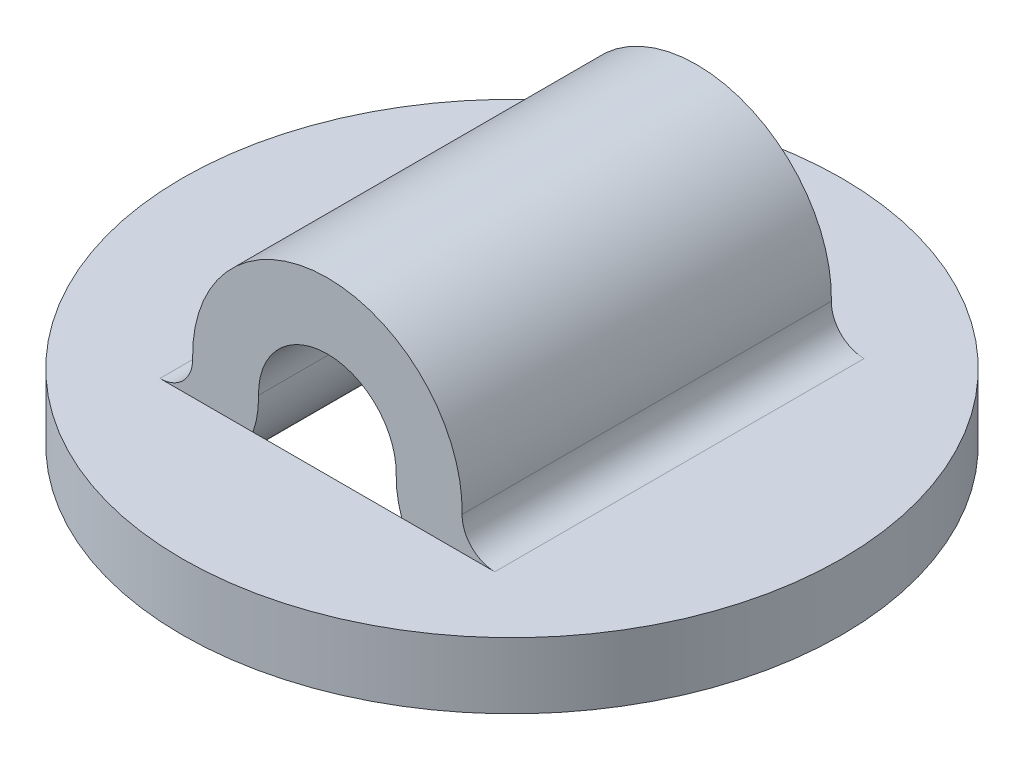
ISO-10303-21;
HEADER;
FILE_DESCRIPTION(('STEP AP214'),'2;1');
FILE_NAME('part.step','',(''),(''),'','','');
FILE_SCHEMA(('AUTOMOTIVE_DESIGN { 1 0 10303 214 1 1 1 1 }'));
ENDSEC;
DATA;
#1=APPLICATION_CONTEXT('core data for automotive mechanical design processes');
#2=APPLICATION_PROTOCOL_DEFINITION('international standard','automotive_design',2000,#1);
#3=PRODUCT_CONTEXT('',#1,'mechanical');
#4=PRODUCT('Part','Part','',(#3));
#5=PRODUCT_RELATED_PRODUCT_CATEGORY('part','',(#4));
#6=PRODUCT_DEFINITION_FORMATION('','',#4);
#7=PRODUCT_DEFINITION_CONTEXT('part definition',#1,'design');
#8=PRODUCT_DEFINITION('design','',#6,#7);
#9=PRODUCT_DEFINITION_SHAPE('','',#8);
#10=(LENGTH_UNIT() NAMED_UNIT(*) SI_UNIT(.MILLI.,.METRE.));
#11=(NAMED_UNIT(*) PLANE_ANGLE_UNIT() SI_UNIT($,.RADIAN.));
#12=(NAMED_UNIT(*) SI_UNIT($,.STERADIAN.) SOLID_ANGLE_UNIT());
#13=UNCERTAINTY_MEASURE_WITH_UNIT(LENGTH_MEASURE(1.E-05),#10,'distance_accuracy_value','');
#14=(GEOMETRIC_REPRESENTATION_CONTEXT(3) GLOBAL_UNCERTAINTY_ASSIGNED_CONTEXT((#13)) GLOBAL_UNIT_ASSIGNED_CONTEXT((#10,
#11,#12)) REPRESENTATION_CONTEXT('',''));
#15=CARTESIAN_POINT('',(0.,0.,0.));
#16=DIRECTION('',(0.,0.,1.));
#17=DIRECTION('',(1.,0.,0.));
#18=AXIS2_PLACEMENT_3D('',#15,#16,#17);
#19=CARTESIAN_POINT('',(0.,1.7399,17.78));
#20=DIRECTION('',(0.,0.,-1.));
#21=DIRECTION('',(-1.,0.,0.));
#22=AXIS2_PLACEMENT_3D('',#19,#20,#21);
#23=CYLINDRICAL_SURFACE('',#22,6.4897);
#24=DIRECTION('',(0.,0.,-1.));
#25=VECTOR('',#24,1.);
#26=CARTESIAN_POINT('',(6.48833987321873,1.60704,17.78));
#27=LINE('',#26,#25);
#28=CARTESIAN_POINT('',(6.48833987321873,1.60704,17.78));
#29=VERTEX_POINT('',#28);
#30=CARTESIAN_POINT('',(6.48833987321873,1.60704,0.));
#31=VERTEX_POINT('',#30);
#32=EDGE_CURVE('E98',#29,#31,#27,.T.);
#33=ORIENTED_EDGE('',*,*,#32,.T.);
#34=CARTESIAN_POINT('',(0.,1.7399,0.));
#35=DIRECTION('',(0.,0.,-1.));
#36=DIRECTION('',(-1.,0.,0.));
#37=AXIS2_PLACEMENT_3D('',#34,#35,#36);
#38=CIRCLE('',#37,6.4897);
#39=CARTESIAN_POINT('',(-6.48833987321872,1.60704,0.));
#40=VERTEX_POINT('',#39);
#41=EDGE_CURVE('E110',#40,#31,#38,.T.);
#42=ORIENTED_EDGE('',*,*,#41,.F.);
#43=DIRECTION('',(0.,0.,-1.));
#44=VECTOR('',#43,1.);
#45=CARTESIAN_POINT('',(-6.48833987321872,1.60704,17.78));
#46=LINE('',#45,#44);
#47=CARTESIAN_POINT('',(-6.48833987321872,1.60704,17.78));
#48=VERTEX_POINT('',#47);
#49=EDGE_CURVE('E113',#40,#48,#46,.F.);
#50=ORIENTED_EDGE('',*,*,#49,.T.);
#51=CARTESIAN_POINT('',(0.,1.7399,17.78));
#52=DIRECTION('',(0.,0.,-1.));
#53=DIRECTION('',(-1.,0.,0.));
#54=AXIS2_PLACEMENT_3D('',#51,#52,#53);
#55=CIRCLE('',#54,6.4897);
#56=EDGE_CURVE('E112',#48,#29,#55,.T.);
#57=ORIENTED_EDGE('',*,*,#56,.T.);
#58=EDGE_LOOP('',(#33,#42,#50,#57));
#59=FACE_BOUND('',#58,.T.);
#60=ADVANCED_FACE('F18',(#59),#23,.T.);
#61=CARTESIAN_POINT('',(-8.06280982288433,1.5748,17.78));
#62=DIRECTION('',(0.,0.,-1.));
#63=DIRECTION('',(-1.,0.,0.));
#64=AXIS2_PLACEMENT_3D('',#61,#62,#63);
#65=CYLINDRICAL_SURFACE('',#64,1.5748);
#66=CARTESIAN_POINT('',(-8.06280982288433,1.5748,17.78));
#67=DIRECTION('',(0.,0.,-1.));
#68=DIRECTION('',(-1.,0.,0.));
#69=AXIS2_PLACEMENT_3D('',#66,#67,#68);
#70=CIRCLE('',#69,1.5748);
#71=CARTESIAN_POINT('',(-8.06280982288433,0.,17.78));
#72=VERTEX_POINT('',#71);
#73=EDGE_CURVE('E21',#72,#48,#70,.F.);
#74=ORIENTED_EDGE('',*,*,#73,.T.);
#75=ORIENTED_EDGE('',*,*,#49,.F.);
#76=CARTESIAN_POINT('',(-8.06280982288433,1.5748,0.));
#77=DIRECTION('',(0.,0.,-1.));
#78=DIRECTION('',(-1.,0.,0.));
#79=AXIS2_PLACEMENT_3D('',#76,#77,#78);
#80=CIRCLE('',#79,1.5748);
#81=CARTESIAN_POINT('',(-8.06280982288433,0.,0.));
#82=VERTEX_POINT('',#81);
#83=EDGE_CURVE('E106',#82,#40,#80,.F.);
#84=ORIENTED_EDGE('',*,*,#83,.F.);
#85=DIRECTION('',(0.,0.,1.));
#86=VECTOR('',#85,1.);
#87=CARTESIAN_POINT('',(-8.06280982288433,0.,17.78));
#88=LINE('',#87,#86);
#89=EDGE_CURVE('E168',#82,#72,#88,.T.);
#90=ORIENTED_EDGE('',*,*,#89,.T.);
#91=EDGE_LOOP('',(#74,#75,#84,#90));
#92=FACE_BOUND('',#91,.T.);
#93=ADVANCED_FACE('F216',(#92),#65,.F.);
#94=CARTESIAN_POINT('',(8.06280982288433,1.5748,17.78));
#95=DIRECTION('',(0.,0.,-1.));
#96=DIRECTION('',(-1.,0.,0.));
#97=AXIS2_PLACEMENT_3D('',#94,#95,#96);
#98=CYLINDRICAL_SURFACE('',#97,1.5748);
#99=CARTESIAN_POINT('',(8.06280982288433,1.5748,17.78));
#100=DIRECTION('',(0.,0.,-1.));
#101=DIRECTION('',(-1.,0.,0.));
#102=AXIS2_PLACEMENT_3D('',#99,#100,#101);
#103=CIRCLE('',#102,1.5748);
#104=CARTESIAN_POINT('',(8.06280982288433,0.,17.78));
#105=VERTEX_POINT('',#104);
#106=EDGE_CURVE('E90',#29,#105,#103,.F.);
#107=ORIENTED_EDGE('',*,*,#106,.T.);
#108=DIRECTION('',(0.,0.,1.));
#109=VECTOR('',#108,1.);
#110=CARTESIAN_POINT('',(8.06280982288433,0.,17.78));
#111=LINE('',#110,#109);
#112=CARTESIAN_POINT('',(8.06280982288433,0.,0.));
#113=VERTEX_POINT('',#112);
#114=EDGE_CURVE('E101',#105,#113,#111,.F.);
#115=ORIENTED_EDGE('',*,*,#114,.T.);
#116=CARTESIAN_POINT('',(8.06280982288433,1.5748,0.));
#117=DIRECTION('',(0.,0.,-1.));
#118=DIRECTION('',(-1.,0.,0.));
#119=AXIS2_PLACEMENT_3D('',#116,#117,#118);
#120=CIRCLE('',#119,1.5748);
#121=EDGE_CURVE('E95',#31,#113,#120,.F.);
#122=ORIENTED_EDGE('',*,*,#121,.F.);
#123=ORIENTED_EDGE('',*,*,#32,.F.);
#124=EDGE_LOOP('',(#107,#115,#122,#123));
#125=FACE_BOUND('',#124,.T.);
#126=ADVANCED_FACE('F97',(#125),#98,.F.);
#127=CARTESIAN_POINT('',(-8.06280982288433,1.5748,17.78));
#128=DIRECTION('',(0.,0.,-1.));
#129=DIRECTION('',(-1.,0.,0.));
#130=AXIS2_PLACEMENT_3D('',#127,#128,#129);
#131=PLANE('',#130);
#132=ORIENTED_EDGE('',*,*,#106,.F.);
#133=ORIENTED_EDGE('',*,*,#56,.F.);
#134=ORIENTED_EDGE('',*,*,#73,.F.);
#135=DIRECTION('',(1.,0.,0.));
#136=VECTOR('',#135,1.);
#137=CARTESIAN_POINT('',(8.06280982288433,0.,17.78));
#138=LINE('',#137,#136);
#139=CARTESIAN_POINT('',(-3.58167101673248,0.,17.78));
#140=VERTEX_POINT('',#139);
#141=EDGE_CURVE('E171',#72,#140,#138,.T.);
#142=ORIENTED_EDGE('',*,*,#141,.T.);
#143=CARTESIAN_POINT('',(-8.06280982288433,1.5748,17.78));
#144=DIRECTION('',(0.,0.,-1.));
#145=DIRECTION('',(-1.,0.,0.));
#146=AXIS2_PLACEMENT_3D('',#143,#144,#145);
#147=CIRCLE('',#146,4.7498);
#148=CARTESIAN_POINT('',(-3.31400529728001,1.67204,17.78));
#149=VERTEX_POINT('',#148);
#150=EDGE_CURVE('E151',#149,#140,#147,.T.);
#151=ORIENTED_EDGE('',*,*,#150,.F.);
#152=CARTESIAN_POINT('',(0.,1.7399,17.78));
#153=DIRECTION('',(0.,0.,-1.));
#154=DIRECTION('',(-1.,0.,0.));
#155=AXIS2_PLACEMENT_3D('',#152,#153,#154);
#156=CIRCLE('',#155,3.3147);
#157=CARTESIAN_POINT('',(3.31400529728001,1.67204,17.78));
#158=VERTEX_POINT('',#157);
#159=EDGE_CURVE('E121',#149,#158,#156,.T.);
#160=ORIENTED_EDGE('',*,*,#159,.T.);
#161=CARTESIAN_POINT('',(8.06280982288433,1.5748,17.78));
#162=DIRECTION('',(0.,0.,-1.));
#163=DIRECTION('',(-1.,0.,0.));
#164=AXIS2_PLACEMENT_3D('',#161,#162,#163);
#165=CIRCLE('',#164,4.7498);
#166=CARTESIAN_POINT('',(3.58167101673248,0.,17.78));
#167=VERTEX_POINT('',#166);
#168=EDGE_CURVE('E160',#167,#158,#165,.T.);
#169=ORIENTED_EDGE('',*,*,#168,.F.);
#170=DIRECTION('',(1.,0.,0.));
#171=VECTOR('',#170,1.);
#172=CARTESIAN_POINT('',(8.06280982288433,0.,17.78));
#173=LINE('',#172,#171);
#174=EDGE_CURVE('E178',#167,#105,#173,.T.);
#175=ORIENTED_EDGE('',*,*,#174,.T.);
#176=EDGE_LOOP('',(#132,#133,#134,#142,#151,#160,#169,#175));
#177=FACE_BOUND('',#176,.T.);
#178=ADVANCED_FACE('F215',(#177),#131,.F.);
#179=CARTESIAN_POINT('',(-8.06280982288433,1.5748,0.));
#180=DIRECTION('',(0.,0.,-1.));
#181=DIRECTION('',(-1.,0.,0.));
#182=AXIS2_PLACEMENT_3D('',#179,#180,#181);
#183=PLANE('',#182);
#184=ORIENTED_EDGE('',*,*,#83,.T.);
#185=ORIENTED_EDGE('',*,*,#41,.T.);
#186=ORIENTED_EDGE('',*,*,#121,.T.);
#187=DIRECTION('',(1.,0.,0.));
#188=VECTOR('',#187,1.);
#189=CARTESIAN_POINT('',(8.06280982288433,0.,0.));
#190=LINE('',#189,#188);
#191=CARTESIAN_POINT('',(3.58167101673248,0.,0.));
#192=VERTEX_POINT('',#191);
#193=EDGE_CURVE('E164',#113,#192,#190,.F.);
#194=ORIENTED_EDGE('',*,*,#193,.T.);
#195=CARTESIAN_POINT('',(8.06280982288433,1.5748,0.));
#196=DIRECTION('',(0.,0.,-1.));
#197=DIRECTION('',(-1.,0.,0.));
#198=AXIS2_PLACEMENT_3D('',#195,#196,#197);
#199=CIRCLE('',#198,4.7498);
#200=CARTESIAN_POINT('',(3.31400529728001,1.67204,0.));
#201=VERTEX_POINT('',#200);
#202=EDGE_CURVE('E158',#201,#192,#199,.F.);
#203=ORIENTED_EDGE('',*,*,#202,.F.);
#204=CARTESIAN_POINT('',(0.,1.7399,0.));
#205=DIRECTION('',(0.,0.,-1.));
#206=DIRECTION('',(-1.,0.,0.));
#207=AXIS2_PLACEMENT_3D('',#204,#205,#206);
#208=CIRCLE('',#207,3.3147);
#209=CARTESIAN_POINT('',(-3.31400529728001,1.67204,0.));
#210=VERTEX_POINT('',#209);
#211=EDGE_CURVE('E118',#201,#210,#208,.F.);
#212=ORIENTED_EDGE('',*,*,#211,.T.);
#213=CARTESIAN_POINT('',(-8.06280982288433,1.5748,0.));
#214=DIRECTION('',(0.,0.,-1.));
#215=DIRECTION('',(-1.,0.,0.));
#216=AXIS2_PLACEMENT_3D('',#213,#214,#215);
#217=CIRCLE('',#216,4.7498);
#218=CARTESIAN_POINT('',(-3.58167101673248,0.,0.));
#219=VERTEX_POINT('',#218);
#220=EDGE_CURVE('E146',#219,#210,#217,.F.);
#221=ORIENTED_EDGE('',*,*,#220,.F.);
#222=DIRECTION('',(1.,0.,0.));
#223=VECTOR('',#222,1.);
#224=CARTESIAN_POINT('',(8.06280982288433,0.,0.));
#225=LINE('',#224,#223);
#226=EDGE_CURVE('E165',#219,#82,#225,.F.);
#227=ORIENTED_EDGE('',*,*,#226,.T.);
#228=EDGE_LOOP('',(#184,#185,#186,#194,#203,#212,#221,#227));
#229=FACE_BOUND('',#228,.T.);
#230=ADVANCED_FACE('F116',(#229),#183,.T.);
#231=CARTESIAN_POINT('',(0.,1.7399,17.78));
#232=DIRECTION('',(0.,0.,-1.));
#233=DIRECTION('',(-1.,0.,0.));
#234=AXIS2_PLACEMENT_3D('',#231,#232,#233);
#235=CYLINDRICAL_SURFACE('',#234,3.3147);
#236=ORIENTED_EDGE('',*,*,#159,.F.);
#237=DIRECTION('',(0.,0.,-1.));
#238=VECTOR('',#237,1.);
#239=CARTESIAN_POINT('',(-3.31400529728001,1.67204,17.78));
#240=LINE('',#239,#238);
#241=EDGE_CURVE('E148',#210,#149,#240,.F.);
#242=ORIENTED_EDGE('',*,*,#241,.F.);
#243=ORIENTED_EDGE('',*,*,#211,.F.);
#244=DIRECTION('',(0.,0.,-1.));
#245=VECTOR('',#244,1.);
#246=CARTESIAN_POINT('',(3.31400529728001,1.67204,17.78));
#247=LINE('',#246,#245);
#248=EDGE_CURVE('E127',#158,#201,#247,.T.);
#249=ORIENTED_EDGE('',*,*,#248,.F.);
#250=EDGE_LOOP('',(#236,#242,#243,#249));
#251=FACE_BOUND('',#250,.T.);
#252=ADVANCED_FACE('F213',(#251),#235,.F.);
#253=CARTESIAN_POINT('',(8.06280982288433,0.,17.78));
#254=DIRECTION('',(0.,-1.,0.));
#255=DIRECTION('',(1.,0.,0.));
#256=AXIS2_PLACEMENT_3D('',#253,#254,#255);
#257=PLANE('',#256);
#258=ORIENTED_EDGE('',*,*,#193,.F.);
#259=ORIENTED_EDGE('',*,*,#114,.F.);
#260=ORIENTED_EDGE('',*,*,#174,.F.);
#261=DIRECTION('',(1.,0.,0.));
#262=VECTOR('',#261,1.);
#263=CARTESIAN_POINT('',(8.06280982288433,0.,17.78));
#264=LINE('',#263,#262);
#265=EDGE_CURVE('E157',#167,#140,#264,.F.);
#266=ORIENTED_EDGE('',*,*,#265,.T.);
#267=ORIENTED_EDGE('',*,*,#141,.F.);
#268=ORIENTED_EDGE('',*,*,#89,.F.);
#269=ORIENTED_EDGE('',*,*,#226,.F.);
#270=DIRECTION('',(1.,0.,0.));
#271=VECTOR('',#270,1.);
#272=CARTESIAN_POINT('',(8.06280982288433,0.,0.));
#273=LINE('',#272,#271);
#274=EDGE_CURVE('E145',#192,#219,#273,.F.);
#275=ORIENTED_EDGE('',*,*,#274,.F.);
#276=EDGE_LOOP('',(#258,#259,#260,#266,#267,#268,#269,#275));
#277=FACE_BOUND('',#276,.T.);
#278=CARTESIAN_POINT('',(0.,0.,8.89));
#279=DIRECTION('',(0.,-1.,0.));
#280=DIRECTION('',(0.,0.,-1.));
#281=AXIS2_PLACEMENT_3D('',#278,#279,#280);
#282=CIRCLE('',#281,15.875);
#283=CARTESIAN_POINT('',(0.,0.,-6.985));
#284=VERTEX_POINT('',#283);
#285=EDGE_CURVE('E162',#284,#284,#282,.T.);
#286=ORIENTED_EDGE('',*,*,#285,.F.);
#287=EDGE_LOOP('',(#286));
#288=FACE_BOUND('',#287,.T.);
#289=ADVANCED_FACE('F187',(#277,#288),#257,.F.);
#290=CARTESIAN_POINT('',(0.,0.,8.89));
#291=DIRECTION('',(0.,-1.,0.));
#292=DIRECTION('',(0.,0.,-1.));
#293=AXIS2_PLACEMENT_3D('',#290,#291,#292);
#294=CYLINDRICAL_SURFACE('',#293,15.875);
#295=CARTESIAN_POINT('',(0.,-3.175,8.89));
#296=DIRECTION('',(0.,-1.,0.));
#297=DIRECTION('',(0.,0.,-1.));
#298=AXIS2_PLACEMENT_3D('',#295,#296,#297);
#299=CIRCLE('',#298,15.875);
#300=CARTESIAN_POINT('',(0.,-3.175,-6.985));
#301=VERTEX_POINT('',#300);
#302=EDGE_CURVE('E137',#301,#301,#299,.F.);
#303=ORIENTED_EDGE('',*,*,#302,.T.);
#304=EDGE_LOOP('',(#303));
#305=FACE_BOUND('',#304,.T.);
#306=ORIENTED_EDGE('',*,*,#285,.T.);
#307=EDGE_LOOP('',(#306));
#308=FACE_BOUND('',#307,.T.);
#309=ADVANCED_FACE('F237',(#305,#308),#294,.T.);
#310=CARTESIAN_POINT('',(8.06280982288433,1.5748,17.78));
#311=DIRECTION('',(0.,0.,-1.));
#312=DIRECTION('',(-1.,0.,0.));
#313=AXIS2_PLACEMENT_3D('',#310,#311,#312);
#314=CYLINDRICAL_SURFACE('',#313,4.7498);
#315=DIRECTION('',(0.,0.,1.));
#316=VECTOR('',#315,1.);
#317=CARTESIAN_POINT('',(8.06280982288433,-3.175,17.78));
#318=LINE('',#317,#316);
#319=CARTESIAN_POINT('',(8.06280982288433,-3.175,0.));
#320=VERTEX_POINT('',#319);
#321=CARTESIAN_POINT('',(8.06280982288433,-3.175,17.78));
#322=VERTEX_POINT('',#321);
#323=EDGE_CURVE('E140',#320,#322,#318,.T.);
#324=ORIENTED_EDGE('',*,*,#323,.T.);
#325=CARTESIAN_POINT('',(8.06280982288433,1.5748,17.78));
#326=DIRECTION('',(0.,0.,-1.));
#327=DIRECTION('',(-1.,0.,0.));
#328=AXIS2_PLACEMENT_3D('',#325,#326,#327);
#329=CIRCLE('',#328,4.7498);
#330=EDGE_CURVE('E154',#322,#167,#329,.T.);
#331=ORIENTED_EDGE('',*,*,#330,.T.);
#332=ORIENTED_EDGE('',*,*,#168,.T.);
#333=ORIENTED_EDGE('',*,*,#248,.T.);
#334=ORIENTED_EDGE('',*,*,#202,.T.);
#335=CARTESIAN_POINT('',(8.06280982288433,1.5748,0.));
#336=DIRECTION('',(0.,0.,-1.));
#337=DIRECTION('',(-1.,0.,0.));
#338=AXIS2_PLACEMENT_3D('',#335,#336,#337);
#339=CIRCLE('',#338,4.7498);
#340=EDGE_CURVE('E141',#320,#192,#339,.T.);
#341=ORIENTED_EDGE('',*,*,#340,.F.);
#342=EDGE_LOOP('',(#324,#331,#332,#333,#334,#341));
#343=FACE_BOUND('',#342,.T.);
#344=ADVANCED_FACE('F211',(#343),#314,.T.);
#345=CARTESIAN_POINT('',(8.06280982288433,1.5748,17.78));
#346=DIRECTION('',(0.,0.,1.));
#347=DIRECTION('',(1.,0.,0.));
#348=AXIS2_PLACEMENT_3D('',#345,#346,#347);
#349=PLANE('',#348);
#350=DIRECTION('',(1.,0.,0.));
#351=VECTOR('',#350,1.);
#352=CARTESIAN_POINT('',(-15.875,-3.175,17.78));
#353=LINE('',#352,#351);
#354=CARTESIAN_POINT('',(-8.06280982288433,-3.175,17.78));
#355=VERTEX_POINT('',#354);
#356=EDGE_CURVE('E193',#322,#355,#353,.F.);
#357=ORIENTED_EDGE('',*,*,#356,.T.);
#358=CARTESIAN_POINT('',(-8.06280982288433,1.5748,17.78));
#359=DIRECTION('',(0.,0.,-1.));
#360=DIRECTION('',(-1.,0.,0.));
#361=AXIS2_PLACEMENT_3D('',#358,#359,#360);
#362=CIRCLE('',#361,4.7498);
#363=EDGE_CURVE('E149',#140,#355,#362,.T.);
#364=ORIENTED_EDGE('',*,*,#363,.F.);
#365=ORIENTED_EDGE('',*,*,#265,.F.);
#366=ORIENTED_EDGE('',*,*,#330,.F.);
#367=EDGE_LOOP('',(#357,#364,#365,#366));
#368=FACE_BOUND('',#367,.T.);
#369=ADVANCED_FACE('F202',(#368),#349,.F.);
#370=CARTESIAN_POINT('',(-8.06280982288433,1.5748,17.78));
#371=DIRECTION('',(0.,0.,-1.));
#372=DIRECTION('',(-1.,0.,0.));
#373=AXIS2_PLACEMENT_3D('',#370,#371,#372);
#374=CYLINDRICAL_SURFACE('',#373,4.7498);
#375=ORIENTED_EDGE('',*,*,#220,.T.);
#376=ORIENTED_EDGE('',*,*,#241,.T.);
#377=ORIENTED_EDGE('',*,*,#150,.T.);
#378=ORIENTED_EDGE('',*,*,#363,.T.);
#379=DIRECTION('',(0.,0.,1.));
#380=VECTOR('',#379,1.);
#381=CARTESIAN_POINT('',(-8.06280982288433,-3.175,17.78));
#382=LINE('',#381,#380);
#383=CARTESIAN_POINT('',(-8.06280982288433,-3.175,0.));
#384=VERTEX_POINT('',#383);
#385=EDGE_CURVE('E27',#355,#384,#382,.F.);
#386=ORIENTED_EDGE('',*,*,#385,.T.);
#387=CARTESIAN_POINT('',(-8.06280982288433,1.5748,0.));
#388=DIRECTION('',(0.,0.,-1.));
#389=DIRECTION('',(-1.,0.,0.));
#390=AXIS2_PLACEMENT_3D('',#387,#388,#389);
#391=CIRCLE('',#390,4.7498);
#392=EDGE_CURVE('E35',#219,#384,#391,.T.);
#393=ORIENTED_EDGE('',*,*,#392,.F.);
#394=EDGE_LOOP('',(#375,#376,#377,#378,#386,#393));
#395=FACE_BOUND('',#394,.T.);
#396=ADVANCED_FACE('F206',(#395),#374,.T.);
#397=CARTESIAN_POINT('',(8.06280982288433,1.5748,0.));
#398=DIRECTION('',(0.,0.,1.));
#399=DIRECTION('',(1.,0.,0.));
#400=AXIS2_PLACEMENT_3D('',#397,#398,#399);
#401=PLANE('',#400);
#402=DIRECTION('',(1.,0.,0.));
#403=VECTOR('',#402,1.);
#404=CARTESIAN_POINT('',(-15.875,-3.175,0.));
#405=LINE('',#404,#403);
#406=EDGE_CURVE('E11',#384,#320,#405,.T.);
#407=ORIENTED_EDGE('',*,*,#406,.T.);
#408=ORIENTED_EDGE('',*,*,#340,.T.);
#409=ORIENTED_EDGE('',*,*,#274,.T.);
#410=ORIENTED_EDGE('',*,*,#392,.T.);
#411=EDGE_LOOP('',(#407,#408,#409,#410));
#412=FACE_BOUND('',#411,.T.);
#413=ADVANCED_FACE('F185',(#412),#401,.T.);
#414=CARTESIAN_POINT('',(-15.875,-3.175,17.78));
#415=DIRECTION('',(0.,1.,0.));
#416=DIRECTION('',(0.,0.,1.));
#417=AXIS2_PLACEMENT_3D('',#414,#415,#416);
#418=PLANE('',#417);
#419=ORIENTED_EDGE('',*,*,#385,.F.);
#420=ORIENTED_EDGE('',*,*,#356,.F.);
#421=ORIENTED_EDGE('',*,*,#323,.F.);
#422=ORIENTED_EDGE('',*,*,#406,.F.);
#423=EDGE_LOOP('',(#419,#420,#421,#422));
#424=FACE_BOUND('',#423,.T.);
#425=ORIENTED_EDGE('',*,*,#302,.F.);
#426=EDGE_LOOP('',(#425));
#427=FACE_BOUND('',#426,.T.);
#428=ADVANCED_FACE('F208',(#424,#427),#418,.F.);
#429=CLOSED_SHELL('',(#60,#93,#126,#178,#230,#252,#289,#309,#344,#369,#396,#413,#428));
#430=MANIFOLD_SOLID_BREP('B1',#429);
#431=ADVANCED_BREP_SHAPE_REPRESENTATION('',(#18,#430),#14);
#432=SHAPE_DEFINITION_REPRESENTATION(#9,#431);
ENDSEC;
END-ISO-10303-21;
